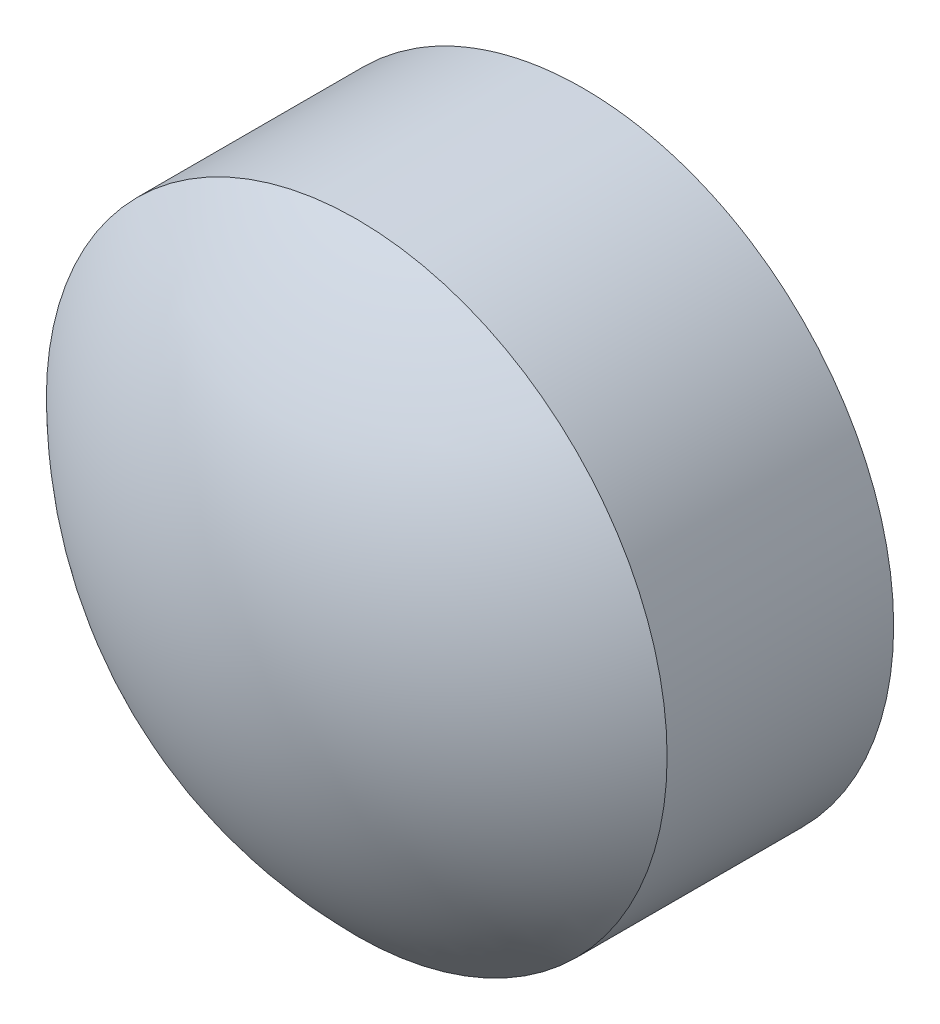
ISO-10303-21;
HEADER;
FILE_DESCRIPTION(('STEP AP214'),'2;1');
FILE_NAME('part.step','',(''),(''),'','','');
FILE_SCHEMA(('AUTOMOTIVE_DESIGN { 1 0 10303 214 1 1 1 1 }'));
ENDSEC;
DATA;
#1=APPLICATION_CONTEXT('core data for automotive mechanical design processes');
#2=APPLICATION_PROTOCOL_DEFINITION('international standard','automotive_design',2000,#1);
#3=PRODUCT_CONTEXT('',#1,'mechanical');
#4=PRODUCT('Part','Part','',(#3));
#5=PRODUCT_RELATED_PRODUCT_CATEGORY('part','',(#4));
#6=PRODUCT_DEFINITION_FORMATION('','',#4);
#7=PRODUCT_DEFINITION_CONTEXT('part definition',#1,'design');
#8=PRODUCT_DEFINITION('design','',#6,#7);
#9=PRODUCT_DEFINITION_SHAPE('','',#8);
#10=(LENGTH_UNIT() NAMED_UNIT(*) SI_UNIT(.MILLI.,.METRE.));
#11=(NAMED_UNIT(*) PLANE_ANGLE_UNIT() SI_UNIT($,.RADIAN.));
#12=(NAMED_UNIT(*) SI_UNIT($,.STERADIAN.) SOLID_ANGLE_UNIT());
#13=UNCERTAINTY_MEASURE_WITH_UNIT(LENGTH_MEASURE(1.E-05),#10,'distance_accuracy_value','');
#14=(GEOMETRIC_REPRESENTATION_CONTEXT(3) GLOBAL_UNCERTAINTY_ASSIGNED_CONTEXT((#13)) GLOBAL_UNIT_ASSIGNED_CONTEXT((#10,
#11,#12)) REPRESENTATION_CONTEXT('',''));
#15=CARTESIAN_POINT('',(0.,0.,0.));
#16=DIRECTION('',(0.,0.,1.));
#17=DIRECTION('',(1.,0.,0.));
#18=AXIS2_PLACEMENT_3D('',#15,#16,#17);
#19=CARTESIAN_POINT('',(0.,0.,88.6704897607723));
#20=DIRECTION('',(0.,0.,1.));
#21=DIRECTION('',(1.,0.,0.));
#22=AXIS2_PLACEMENT_3D('',#19,#20,#21);
#23=CYLINDRICAL_SURFACE('',#22,25.);
#24=CARTESIAN_POINT('',(0.,0.,106.91696327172));
#25=DIRECTION('',(0.,0.,1.));
#26=DIRECTION('',(1.,0.,0.));
#27=AXIS2_PLACEMENT_3D('',#24,#25,#26);
#28=CIRCLE('',#27,25.);
#29=CARTESIAN_POINT('',(25.,0.,106.91696327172));
#30=VERTEX_POINT('',#29);
#31=EDGE_CURVE('E19',#30,#30,#28,.T.);
#32=ORIENTED_EDGE('',*,*,#31,.F.);
#33=EDGE_LOOP('',(#32));
#34=FACE_BOUND('',#33,.T.);
#35=CARTESIAN_POINT('',(0.,0.,88.6704897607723));
#36=DIRECTION('',(0.,0.,1.));
#37=DIRECTION('',(1.,0.,0.));
#38=AXIS2_PLACEMENT_3D('',#35,#36,#37);
#39=CIRCLE('',#38,25.);
#40=CARTESIAN_POINT('',(25.,0.,88.6704897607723));
#41=VERTEX_POINT('',#40);
#42=EDGE_CURVE('E10',#41,#41,#39,.T.);
#43=ORIENTED_EDGE('',*,*,#42,.T.);
#44=EDGE_LOOP('',(#43));
#45=FACE_BOUND('',#44,.T.);
#46=ADVANCED_FACE('F14',(#34,#45),#23,.T.);
#47=CARTESIAN_POINT('',(0.,0.,81.800164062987));
#48=DIRECTION('',(0.,-1.,0.));
#49=DIRECTION('',(0.,0.,1.));
#50=AXIS2_PLACEMENT_3D('',#47,#48,#49);
#51=SPHERICAL_SURFACE('',#50,35.438024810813);
#52=ORIENTED_EDGE('',*,*,#31,.T.);
#53=EDGE_LOOP('',(#52));
#54=FACE_BOUND('',#53,.T.);
#55=ADVANCED_FACE('F29',(#54),#51,.T.);
#56=CARTESIAN_POINT('',(0.,0.,66.7524109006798));
#57=DIRECTION('',(0.,1.,0.));
#58=DIRECTION('',(0.,0.,1.));
#59=AXIS2_PLACEMENT_3D('',#56,#57,#58);
#60=SPHERICAL_SURFACE('',#59,33.2475890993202);
#61=ORIENTED_EDGE('',*,*,#42,.F.);
#62=EDGE_LOOP('',(#61));
#63=FACE_BOUND('',#62,.T.);
#64=ADVANCED_FACE('F16',(#63),#60,.F.);
#65=CLOSED_SHELL('',(#46,#55,#64));
#66=MANIFOLD_SOLID_BREP('B1',#65);
#67=ADVANCED_BREP_SHAPE_REPRESENTATION('',(#18,#66),#14);
#68=SHAPE_DEFINITION_REPRESENTATION(#9,#67);
ENDSEC;
END-ISO-10303-21;
